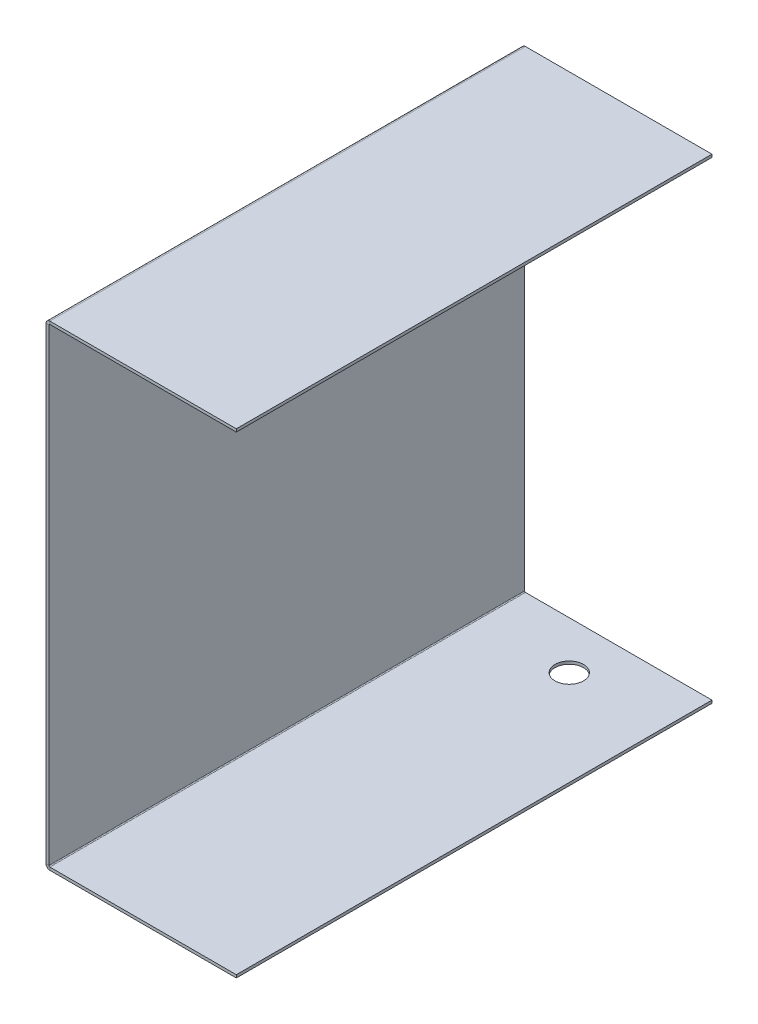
ISO-10303-21;
HEADER;
FILE_DESCRIPTION(('STEP AP214'),'2;1');
FILE_NAME('part.step','',(''),(''),'','','');
FILE_SCHEMA(('AUTOMOTIVE_DESIGN { 1 0 10303 214 1 1 1 1 }'));
ENDSEC;
DATA;
#1=APPLICATION_CONTEXT('core data for automotive mechanical design processes');
#2=APPLICATION_PROTOCOL_DEFINITION('international standard','automotive_design',2000,#1);
#3=PRODUCT_CONTEXT('',#1,'mechanical');
#4=PRODUCT('Part','Part','',(#3));
#5=PRODUCT_RELATED_PRODUCT_CATEGORY('part','',(#4));
#6=PRODUCT_DEFINITION_FORMATION('','',#4);
#7=PRODUCT_DEFINITION_CONTEXT('part definition',#1,'design');
#8=PRODUCT_DEFINITION('design','',#6,#7);
#9=PRODUCT_DEFINITION_SHAPE('','',#8);
#10=(LENGTH_UNIT() NAMED_UNIT(*) SI_UNIT(.MILLI.,.METRE.));
#11=(NAMED_UNIT(*) PLANE_ANGLE_UNIT() SI_UNIT($,.RADIAN.));
#12=(NAMED_UNIT(*) SI_UNIT($,.STERADIAN.) SOLID_ANGLE_UNIT());
#13=UNCERTAINTY_MEASURE_WITH_UNIT(LENGTH_MEASURE(1.E-05),#10,'distance_accuracy_value','');
#14=(GEOMETRIC_REPRESENTATION_CONTEXT(3) GLOBAL_UNCERTAINTY_ASSIGNED_CONTEXT((#13)) GLOBAL_UNIT_ASSIGNED_CONTEXT((#10,
#11,#12)) REPRESENTATION_CONTEXT('',''));
#15=CARTESIAN_POINT('',(0.,0.,0.));
#16=DIRECTION('',(0.,0.,1.));
#17=DIRECTION('',(1.,0.,0.));
#18=AXIS2_PLACEMENT_3D('',#15,#16,#17);
#19=CARTESIAN_POINT('',(-196.,0.,500.000000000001));
#20=DIRECTION('',(0.,0.,1.));
#21=DIRECTION('',(1.,0.,0.));
#22=AXIS2_PLACEMENT_3D('',#19,#20,#21);
#23=PLANE('',#22);
#24=DIRECTION('',(0.,-1.,0.));
#25=VECTOR('',#24,1.);
#26=CARTESIAN_POINT('',(-196.,0.,500.000000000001));
#27=LINE('',#26,#25);
#28=CARTESIAN_POINT('',(-196.,0.,500.000000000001));
#29=VERTEX_POINT('',#28);
#30=CARTESIAN_POINT('',(-196.,-3.00000000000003,500.000000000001));
#31=VERTEX_POINT('',#30);
#32=EDGE_CURVE('E11',#29,#31,#27,.T.);
#33=ORIENTED_EDGE('',*,*,#32,.F.);
#34=CARTESIAN_POINT('',(-196.,-4.00000000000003,500.000000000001));
#35=DIRECTION('',(0.,0.,-1.));
#36=DIRECTION('',(-1.,0.,0.));
#37=AXIS2_PLACEMENT_3D('',#34,#35,#36);
#38=CIRCLE('',#37,4.);
#39=CARTESIAN_POINT('',(-200.,-4.00000000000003,499.999999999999));
#40=VERTEX_POINT('',#39);
#41=EDGE_CURVE('E199',#29,#40,#38,.F.);
#42=ORIENTED_EDGE('',*,*,#41,.T.);
#43=DIRECTION('',(-1.,0.,0.));
#44=VECTOR('',#43,1.);
#45=CARTESIAN_POINT('',(-197.,-4.00000000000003,500.));
#46=LINE('',#45,#44);
#47=CARTESIAN_POINT('',(-197.,-4.00000000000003,500.));
#48=VERTEX_POINT('',#47);
#49=EDGE_CURVE('E39',#48,#40,#46,.T.);
#50=ORIENTED_EDGE('',*,*,#49,.F.);
#51=CARTESIAN_POINT('',(-196.,-4.00000000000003,500.000000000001));
#52=DIRECTION('',(0.,0.,1.));
#53=DIRECTION('',(1.,0.,0.));
#54=AXIS2_PLACEMENT_3D('',#51,#52,#53);
#55=CIRCLE('',#54,1.);
#56=EDGE_CURVE('E187',#31,#48,#55,.T.);
#57=ORIENTED_EDGE('',*,*,#56,.F.);
#58=EDGE_LOOP('',(#33,#42,#50,#57));
#59=FACE_BOUND('',#58,.T.);
#60=ADVANCED_FACE('F31',(#59),#23,.T.);
#61=CARTESIAN_POINT('',(-197.,-4.00000000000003,500.));
#62=DIRECTION('',(0.,0.,1.));
#63=DIRECTION('',(1.,0.,0.));
#64=AXIS2_PLACEMENT_3D('',#61,#62,#63);
#65=PLANE('',#64);
#66=DIRECTION('',(-1.,0.,0.));
#67=VECTOR('',#66,1.);
#68=CARTESIAN_POINT('',(-1.11022302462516E-13,0.,500.));
#69=LINE('',#68,#67);
#70=CARTESIAN_POINT('',(-1.11022302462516E-13,0.,500.));
#71=VERTEX_POINT('',#70);
#72=EDGE_CURVE('E196',#71,#29,#69,.T.);
#73=ORIENTED_EDGE('',*,*,#72,.T.);
#74=ORIENTED_EDGE('',*,*,#32,.T.);
#75=DIRECTION('',(-1.,0.,0.));
#76=VECTOR('',#75,1.);
#77=CARTESIAN_POINT('',(-1.11022302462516E-13,-3.,500.));
#78=LINE('',#77,#76);
#79=CARTESIAN_POINT('',(-1.11022302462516E-13,-3.,500.));
#80=VERTEX_POINT('',#79);
#81=EDGE_CURVE('E190',#80,#31,#78,.T.);
#82=ORIENTED_EDGE('',*,*,#81,.F.);
#83=DIRECTION('',(0.,-1.,0.));
#84=VECTOR('',#83,1.);
#85=CARTESIAN_POINT('',(-1.11022302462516E-13,0.,500.));
#86=LINE('',#85,#84);
#87=EDGE_CURVE('E193',#71,#80,#86,.T.);
#88=ORIENTED_EDGE('',*,*,#87,.F.);
#89=EDGE_LOOP('',(#73,#74,#82,#88));
#90=FACE_BOUND('',#89,.T.);
#91=ADVANCED_FACE('F284',(#90),#65,.T.);
#92=CARTESIAN_POINT('',(-200.,-4.00000000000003,0.));
#93=DIRECTION('',(0.,0.,-1.));
#94=DIRECTION('',(-1.,0.,0.));
#95=AXIS2_PLACEMENT_3D('',#92,#93,#94);
#96=PLANE('',#95);
#97=DIRECTION('',(1.,0.,0.));
#98=VECTOR('',#97,1.);
#99=CARTESIAN_POINT('',(-200.,-4.00000000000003,0.));
#100=LINE('',#99,#98);
#101=CARTESIAN_POINT('',(-200.,-4.00000000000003,0.));
#102=VERTEX_POINT('',#101);
#103=CARTESIAN_POINT('',(-197.,-4.00000000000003,0.));
#104=VERTEX_POINT('',#103);
#105=EDGE_CURVE('E240',#102,#104,#100,.T.);
#106=ORIENTED_EDGE('',*,*,#105,.F.);
#107=CARTESIAN_POINT('',(-196.,-4.00000000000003,0.));
#108=DIRECTION('',(0.,0.,-1.));
#109=DIRECTION('',(-1.,0.,0.));
#110=AXIS2_PLACEMENT_3D('',#107,#108,#109);
#111=CIRCLE('',#110,4.);
#112=CARTESIAN_POINT('',(-196.,0.,0.));
#113=VERTEX_POINT('',#112);
#114=EDGE_CURVE('E166',#113,#102,#111,.F.);
#115=ORIENTED_EDGE('',*,*,#114,.F.);
#116=DIRECTION('',(0.,1.,0.));
#117=VECTOR('',#116,1.);
#118=CARTESIAN_POINT('',(-196.,-3.00000000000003,0.));
#119=LINE('',#118,#117);
#120=CARTESIAN_POINT('',(-196.,-3.00000000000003,0.));
#121=VERTEX_POINT('',#120);
#122=EDGE_CURVE('E238',#121,#113,#119,.T.);
#123=ORIENTED_EDGE('',*,*,#122,.F.);
#124=CARTESIAN_POINT('',(-196.,-4.00000000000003,0.));
#125=DIRECTION('',(0.,0.,1.));
#126=DIRECTION('',(1.,0.,0.));
#127=AXIS2_PLACEMENT_3D('',#124,#125,#126);
#128=CIRCLE('',#127,1.);
#129=EDGE_CURVE('E154',#121,#104,#128,.T.);
#130=ORIENTED_EDGE('',*,*,#129,.T.);
#131=EDGE_LOOP('',(#106,#115,#123,#130));
#132=FACE_BOUND('',#131,.T.);
#133=ADVANCED_FACE('F294',(#132),#96,.T.);
#134=CARTESIAN_POINT('',(-196.,-3.00000000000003,0.));
#135=DIRECTION('',(0.,0.,-1.));
#136=DIRECTION('',(-1.,0.,0.));
#137=AXIS2_PLACEMENT_3D('',#134,#135,#136);
#138=PLANE('',#137);
#139=DIRECTION('',(0.,-1.,0.));
#140=VECTOR('',#139,1.);
#141=CARTESIAN_POINT('',(-200.,0.,0.));
#142=LINE('',#141,#140);
#143=CARTESIAN_POINT('',(-200.,-496.,0.));
#144=VERTEX_POINT('',#143);
#145=EDGE_CURVE('E169',#102,#144,#142,.T.);
#146=ORIENTED_EDGE('',*,*,#145,.F.);
#147=ORIENTED_EDGE('',*,*,#105,.T.);
#148=DIRECTION('',(0.,-1.,0.));
#149=VECTOR('',#148,1.);
#150=CARTESIAN_POINT('',(-197.,0.,0.));
#151=LINE('',#150,#149);
#152=CARTESIAN_POINT('',(-197.,-496.,0.));
#153=VERTEX_POINT('',#152);
#154=EDGE_CURVE('E151',#104,#153,#151,.T.);
#155=ORIENTED_EDGE('',*,*,#154,.T.);
#156=DIRECTION('',(-1.,0.,0.));
#157=VECTOR('',#156,1.);
#158=CARTESIAN_POINT('',(-197.,-496.,0.));
#159=LINE('',#158,#157);
#160=EDGE_CURVE('E130',#153,#144,#159,.T.);
#161=ORIENTED_EDGE('',*,*,#160,.T.);
#162=EDGE_LOOP('',(#146,#147,#155,#161));
#163=FACE_BOUND('',#162,.T.);
#164=ADVANCED_FACE('F296',(#163),#138,.T.);
#165=CARTESIAN_POINT('',(-200.,-496.,499.999999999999));
#166=DIRECTION('',(0.,0.,1.));
#167=DIRECTION('',(1.,0.,0.));
#168=AXIS2_PLACEMENT_3D('',#165,#166,#167);
#169=PLANE('',#168);
#170=DIRECTION('',(1.,0.,0.));
#171=VECTOR('',#170,1.);
#172=CARTESIAN_POINT('',(-200.,-496.,499.999999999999));
#173=LINE('',#172,#171);
#174=CARTESIAN_POINT('',(-200.,-496.,499.999999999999));
#175=VERTEX_POINT('',#174);
#176=CARTESIAN_POINT('',(-197.,-496.,500.));
#177=VERTEX_POINT('',#176);
#178=EDGE_CURVE('E53',#175,#177,#173,.T.);
#179=ORIENTED_EDGE('',*,*,#178,.F.);
#180=CARTESIAN_POINT('',(-196.,-496.,500.000000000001));
#181=DIRECTION('',(0.,0.,-1.));
#182=DIRECTION('',(-1.,0.,0.));
#183=AXIS2_PLACEMENT_3D('',#180,#181,#182);
#184=CIRCLE('',#183,4.);
#185=CARTESIAN_POINT('',(-196.,-500.,500.000000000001));
#186=VERTEX_POINT('',#185);
#187=EDGE_CURVE('E204',#175,#186,#184,.F.);
#188=ORIENTED_EDGE('',*,*,#187,.T.);
#189=DIRECTION('',(0.,-1.,0.));
#190=VECTOR('',#189,1.);
#191=CARTESIAN_POINT('',(-196.,-497.,500.000000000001));
#192=LINE('',#191,#190);
#193=CARTESIAN_POINT('',(-196.,-497.,500.000000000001));
#194=VERTEX_POINT('',#193);
#195=EDGE_CURVE('E46',#194,#186,#192,.T.);
#196=ORIENTED_EDGE('',*,*,#195,.F.);
#197=CARTESIAN_POINT('',(-196.,-496.,500.000000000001));
#198=DIRECTION('',(0.,0.,1.));
#199=DIRECTION('',(1.,0.,0.));
#200=AXIS2_PLACEMENT_3D('',#197,#198,#199);
#201=CIRCLE('',#200,1.);
#202=EDGE_CURVE('E181',#177,#194,#201,.T.);
#203=ORIENTED_EDGE('',*,*,#202,.F.);
#204=EDGE_LOOP('',(#179,#188,#196,#203));
#205=FACE_BOUND('',#204,.T.);
#206=ADVANCED_FACE('F262',(#205),#169,.T.);
#207=CARTESIAN_POINT('',(-196.,-497.,500.000000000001));
#208=DIRECTION('',(0.,0.,1.));
#209=DIRECTION('',(1.,0.,0.));
#210=AXIS2_PLACEMENT_3D('',#207,#208,#209);
#211=PLANE('',#210);
#212=DIRECTION('',(0.,-1.,0.));
#213=VECTOR('',#212,1.);
#214=CARTESIAN_POINT('',(-200.,0.,499.999999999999));
#215=LINE('',#214,#213);
#216=EDGE_CURVE('E202',#40,#175,#215,.T.);
#217=ORIENTED_EDGE('',*,*,#216,.T.);
#218=ORIENTED_EDGE('',*,*,#178,.T.);
#219=DIRECTION('',(0.,-1.,0.));
#220=VECTOR('',#219,1.);
#221=CARTESIAN_POINT('',(-197.,0.,500.));
#222=LINE('',#221,#220);
#223=EDGE_CURVE('E184',#48,#177,#222,.T.);
#224=ORIENTED_EDGE('',*,*,#223,.F.);
#225=ORIENTED_EDGE('',*,*,#49,.T.);
#226=EDGE_LOOP('',(#217,#218,#224,#225));
#227=FACE_BOUND('',#226,.T.);
#228=ADVANCED_FACE('F244',(#227),#211,.T.);
#229=CARTESIAN_POINT('',(-196.,-500.,0.));
#230=DIRECTION('',(0.,0.,-1.));
#231=DIRECTION('',(-1.,0.,0.));
#232=AXIS2_PLACEMENT_3D('',#229,#230,#231);
#233=PLANE('',#232);
#234=DIRECTION('',(0.,1.,0.));
#235=VECTOR('',#234,1.);
#236=CARTESIAN_POINT('',(-196.,-500.,0.));
#237=LINE('',#236,#235);
#238=CARTESIAN_POINT('',(-196.,-500.,0.));
#239=VERTEX_POINT('',#238);
#240=CARTESIAN_POINT('',(-196.,-497.,0.));
#241=VERTEX_POINT('',#240);
#242=EDGE_CURVE('E234',#239,#241,#237,.T.);
#243=ORIENTED_EDGE('',*,*,#242,.F.);
#244=CARTESIAN_POINT('',(-196.,-496.,0.));
#245=DIRECTION('',(0.,0.,-1.));
#246=DIRECTION('',(-1.,0.,0.));
#247=AXIS2_PLACEMENT_3D('',#244,#245,#246);
#248=CIRCLE('',#247,4.);
#249=EDGE_CURVE('E172',#144,#239,#248,.F.);
#250=ORIENTED_EDGE('',*,*,#249,.F.);
#251=ORIENTED_EDGE('',*,*,#160,.F.);
#252=CARTESIAN_POINT('',(-196.,-496.,0.));
#253=DIRECTION('',(0.,0.,1.));
#254=DIRECTION('',(1.,0.,0.));
#255=AXIS2_PLACEMENT_3D('',#252,#253,#254);
#256=CIRCLE('',#255,1.);
#257=EDGE_CURVE('E145',#153,#241,#256,.T.);
#258=ORIENTED_EDGE('',*,*,#257,.T.);
#259=EDGE_LOOP('',(#243,#250,#251,#258));
#260=FACE_BOUND('',#259,.T.);
#261=ADVANCED_FACE('F298',(#260),#233,.T.);
#262=CARTESIAN_POINT('',(-197.,-496.,0.));
#263=DIRECTION('',(0.,0.,-1.));
#264=DIRECTION('',(-1.,0.,0.));
#265=AXIS2_PLACEMENT_3D('',#262,#263,#264);
#266=PLANE('',#265);
#267=DIRECTION('',(1.,0.,0.));
#268=VECTOR('',#267,1.);
#269=CARTESIAN_POINT('',(-200.,-500.,0.));
#270=LINE('',#269,#268);
#271=CARTESIAN_POINT('',(0.,-500.,0.));
#272=VERTEX_POINT('',#271);
#273=EDGE_CURVE('E135',#239,#272,#270,.T.);
#274=ORIENTED_EDGE('',*,*,#273,.F.);
#275=ORIENTED_EDGE('',*,*,#242,.T.);
#276=DIRECTION('',(1.,0.,0.));
#277=VECTOR('',#276,1.);
#278=CARTESIAN_POINT('',(-200.,-497.,0.));
#279=LINE('',#278,#277);
#280=CARTESIAN_POINT('',(0.,-497.,0.));
#281=VERTEX_POINT('',#280);
#282=EDGE_CURVE('E143',#241,#281,#279,.T.);
#283=ORIENTED_EDGE('',*,*,#282,.T.);
#284=DIRECTION('',(0.,-1.,0.));
#285=VECTOR('',#284,1.);
#286=CARTESIAN_POINT('',(0.,-497.,0.));
#287=LINE('',#286,#285);
#288=EDGE_CURVE('E124',#281,#272,#287,.T.);
#289=ORIENTED_EDGE('',*,*,#288,.T.);
#290=EDGE_LOOP('',(#274,#275,#283,#289));
#291=FACE_BOUND('',#290,.T.);
#292=ADVANCED_FACE('F141',(#291),#266,.T.);
#293=CARTESIAN_POINT('',(-200.,-500.,499.999999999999));
#294=DIRECTION('',(0.,1.,0.));
#295=DIRECTION('',(0.,0.,1.));
#296=AXIS2_PLACEMENT_3D('',#293,#294,#295);
#297=PLANE('',#296);
#298=CARTESIAN_POINT('',(-100.,-500.,50.));
#299=DIRECTION('',(0.,-1.,0.));
#300=DIRECTION('',(0.,0.,-1.));
#301=AXIS2_PLACEMENT_3D('',#298,#299,#300);
#302=CIRCLE('',#301,15.);
#303=CARTESIAN_POINT('',(-100.,-500.,35.));
#304=VERTEX_POINT('',#303);
#305=EDGE_CURVE('E538',#304,#304,#302,.T.);
#306=ORIENTED_EDGE('',*,*,#305,.F.);
#307=EDGE_LOOP('',(#306));
#308=FACE_BOUND('',#307,.T.);
#309=ORIENTED_EDGE('',*,*,#273,.T.);
#310=DIRECTION('',(0.,0.,-1.));
#311=VECTOR('',#310,1.);
#312=CARTESIAN_POINT('',(0.,-500.,500.));
#313=LINE('',#312,#311);
#314=CARTESIAN_POINT('',(0.,-500.,500.));
#315=VERTEX_POINT('',#314);
#316=EDGE_CURVE('E120',#315,#272,#313,.T.);
#317=ORIENTED_EDGE('',*,*,#316,.F.);
#318=DIRECTION('',(1.,0.,0.));
#319=VECTOR('',#318,1.);
#320=CARTESIAN_POINT('',(-200.,-500.,499.999999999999));
#321=LINE('',#320,#319);
#322=EDGE_CURVE('E175',#186,#315,#321,.T.);
#323=ORIENTED_EDGE('',*,*,#322,.F.);
#324=DIRECTION('',(0.,0.,-1.));
#325=VECTOR('',#324,1.);
#326=CARTESIAN_POINT('',(-196.,-500.,500.000000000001));
#327=LINE('',#326,#325);
#328=EDGE_CURVE('E138',#186,#239,#327,.T.);
#329=ORIENTED_EDGE('',*,*,#328,.T.);
#330=EDGE_LOOP('',(#309,#317,#323,#329));
#331=FACE_BOUND('',#330,.T.);
#332=ADVANCED_FACE('F136',(#308,#331),#297,.F.);
#333=CARTESIAN_POINT('',(0.,-497.,500.));
#334=DIRECTION('',(1.,0.,0.));
#335=DIRECTION('',(0.,1.,0.));
#336=AXIS2_PLACEMENT_3D('',#333,#334,#335);
#337=PLANE('',#336);
#338=ORIENTED_EDGE('',*,*,#288,.F.);
#339=DIRECTION('',(0.,0.,-1.));
#340=VECTOR('',#339,1.);
#341=CARTESIAN_POINT('',(0.,-497.,500.));
#342=LINE('',#341,#340);
#343=CARTESIAN_POINT('',(0.,-497.,500.));
#344=VERTEX_POINT('',#343);
#345=EDGE_CURVE('E131',#344,#281,#342,.T.);
#346=ORIENTED_EDGE('',*,*,#345,.F.);
#347=DIRECTION('',(0.,-1.,0.));
#348=VECTOR('',#347,1.);
#349=CARTESIAN_POINT('',(0.,-497.,500.));
#350=LINE('',#349,#348);
#351=EDGE_CURVE('E127',#344,#315,#350,.T.);
#352=ORIENTED_EDGE('',*,*,#351,.T.);
#353=ORIENTED_EDGE('',*,*,#316,.T.);
#354=EDGE_LOOP('',(#338,#346,#352,#353));
#355=FACE_BOUND('',#354,.T.);
#356=ADVANCED_FACE('F122',(#355),#337,.T.);
#357=CARTESIAN_POINT('',(-200.,-497.,499.999999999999));
#358=DIRECTION('',(0.,1.,0.));
#359=DIRECTION('',(0.,0.,1.));
#360=AXIS2_PLACEMENT_3D('',#357,#358,#359);
#361=PLANE('',#360);
#362=CARTESIAN_POINT('',(-100.,-497.,50.));
#363=DIRECTION('',(0.,1.,0.));
#364=DIRECTION('',(0.,0.,1.));
#365=AXIS2_PLACEMENT_3D('',#362,#363,#364);
#366=CIRCLE('',#365,15.);
#367=CARTESIAN_POINT('',(-100.,-497.,65.));
#368=VERTEX_POINT('',#367);
#369=EDGE_CURVE('E34',#368,#368,#366,.T.);
#370=ORIENTED_EDGE('',*,*,#369,.F.);
#371=EDGE_LOOP('',(#370));
#372=FACE_BOUND('',#371,.T.);
#373=ORIENTED_EDGE('',*,*,#282,.F.);
#374=DIRECTION('',(0.,0.,-1.));
#375=VECTOR('',#374,1.);
#376=CARTESIAN_POINT('',(-196.,-497.,500.000000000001));
#377=LINE('',#376,#375);
#378=EDGE_CURVE('E229',#194,#241,#377,.T.);
#379=ORIENTED_EDGE('',*,*,#378,.F.);
#380=DIRECTION('',(1.,0.,0.));
#381=VECTOR('',#380,1.);
#382=CARTESIAN_POINT('',(-200.,-497.,499.999999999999));
#383=LINE('',#382,#381);
#384=EDGE_CURVE('E178',#194,#344,#383,.T.);
#385=ORIENTED_EDGE('',*,*,#384,.T.);
#386=ORIENTED_EDGE('',*,*,#345,.T.);
#387=EDGE_LOOP('',(#373,#379,#385,#386));
#388=FACE_BOUND('',#387,.T.);
#389=ADVANCED_FACE('F265',(#372,#388),#361,.T.);
#390=CARTESIAN_POINT('',(-196.,-496.,500.000000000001));
#391=DIRECTION('',(0.,0.,-1.));
#392=DIRECTION('',(-1.,0.,0.));
#393=AXIS2_PLACEMENT_3D('',#390,#391,#392);
#394=CYLINDRICAL_SURFACE('',#393,1.);
#395=ORIENTED_EDGE('',*,*,#257,.F.);
#396=DIRECTION('',(0.,0.,-1.));
#397=VECTOR('',#396,1.);
#398=CARTESIAN_POINT('',(-197.,-496.,500.));
#399=LINE('',#398,#397);
#400=EDGE_CURVE('E226',#177,#153,#399,.T.);
#401=ORIENTED_EDGE('',*,*,#400,.F.);
#402=ORIENTED_EDGE('',*,*,#202,.T.);
#403=ORIENTED_EDGE('',*,*,#378,.T.);
#404=EDGE_LOOP('',(#395,#401,#402,#403));
#405=FACE_BOUND('',#404,.T.);
#406=ADVANCED_FACE('F270',(#405),#394,.F.);
#407=CARTESIAN_POINT('',(-197.,0.,500.));
#408=DIRECTION('',(1.,0.,0.));
#409=DIRECTION('',(0.,1.,0.));
#410=AXIS2_PLACEMENT_3D('',#407,#408,#409);
#411=PLANE('',#410);
#412=ORIENTED_EDGE('',*,*,#154,.F.);
#413=DIRECTION('',(0.,0.,-1.));
#414=VECTOR('',#413,1.);
#415=CARTESIAN_POINT('',(-197.,-4.00000000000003,500.));
#416=LINE('',#415,#414);
#417=EDGE_CURVE('E223',#48,#104,#416,.T.);
#418=ORIENTED_EDGE('',*,*,#417,.F.);
#419=ORIENTED_EDGE('',*,*,#223,.T.);
#420=ORIENTED_EDGE('',*,*,#400,.T.);
#421=EDGE_LOOP('',(#412,#418,#419,#420));
#422=FACE_BOUND('',#421,.T.);
#423=ADVANCED_FACE('F273',(#422),#411,.T.);
#424=CARTESIAN_POINT('',(-196.,-4.00000000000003,500.000000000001));
#425=DIRECTION('',(0.,0.,-1.));
#426=DIRECTION('',(-1.,0.,0.));
#427=AXIS2_PLACEMENT_3D('',#424,#425,#426);
#428=CYLINDRICAL_SURFACE('',#427,1.);
#429=ORIENTED_EDGE('',*,*,#129,.F.);
#430=DIRECTION('',(0.,0.,-1.));
#431=VECTOR('',#430,1.);
#432=CARTESIAN_POINT('',(-196.,-3.00000000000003,500.000000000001));
#433=LINE('',#432,#431);
#434=EDGE_CURVE('E220',#31,#121,#433,.T.);
#435=ORIENTED_EDGE('',*,*,#434,.F.);
#436=ORIENTED_EDGE('',*,*,#56,.T.);
#437=ORIENTED_EDGE('',*,*,#417,.T.);
#438=EDGE_LOOP('',(#429,#435,#436,#437));
#439=FACE_BOUND('',#438,.T.);
#440=ADVANCED_FACE('F276',(#439),#428,.F.);
#441=CARTESIAN_POINT('',(-1.11022302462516E-13,-3.,500.));
#442=DIRECTION('',(0.,-1.,0.));
#443=DIRECTION('',(1.,0.,0.));
#444=AXIS2_PLACEMENT_3D('',#441,#442,#443);
#445=PLANE('',#444);
#446=DIRECTION('',(-1.,0.,0.));
#447=VECTOR('',#446,1.);
#448=CARTESIAN_POINT('',(0.,-3.,0.));
#449=LINE('',#448,#447);
#450=CARTESIAN_POINT('',(0.,-3.,0.));
#451=VERTEX_POINT('',#450);
#452=EDGE_CURVE('E157',#451,#121,#449,.T.);
#453=ORIENTED_EDGE('',*,*,#452,.F.);
#454=DIRECTION('',(0.,0.,-1.));
#455=VECTOR('',#454,1.);
#456=CARTESIAN_POINT('',(-1.11022302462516E-13,-3.,500.));
#457=LINE('',#456,#455);
#458=EDGE_CURVE('E218',#80,#451,#457,.T.);
#459=ORIENTED_EDGE('',*,*,#458,.F.);
#460=ORIENTED_EDGE('',*,*,#81,.T.);
#461=ORIENTED_EDGE('',*,*,#434,.T.);
#462=EDGE_LOOP('',(#453,#459,#460,#461));
#463=FACE_BOUND('',#462,.T.);
#464=ADVANCED_FACE('F281',(#463),#445,.T.);
#465=CARTESIAN_POINT('',(-1.11022302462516E-13,0.,500.));
#466=DIRECTION('',(1.,0.,0.));
#467=DIRECTION('',(0.,1.,0.));
#468=AXIS2_PLACEMENT_3D('',#465,#466,#467);
#469=PLANE('',#468);
#470=DIRECTION('',(0.,-1.,0.));
#471=VECTOR('',#470,1.);
#472=CARTESIAN_POINT('',(0.,0.,0.));
#473=LINE('',#472,#471);
#474=CARTESIAN_POINT('',(0.,0.,0.));
#475=VERTEX_POINT('',#474);
#476=EDGE_CURVE('E160',#475,#451,#473,.T.);
#477=ORIENTED_EDGE('',*,*,#476,.F.);
#478=DIRECTION('',(0.,0.,-1.));
#479=VECTOR('',#478,1.);
#480=CARTESIAN_POINT('',(-1.11022302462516E-13,0.,500.));
#481=LINE('',#480,#479);
#482=EDGE_CURVE('E216',#71,#475,#481,.T.);
#483=ORIENTED_EDGE('',*,*,#482,.F.);
#484=ORIENTED_EDGE('',*,*,#87,.T.);
#485=ORIENTED_EDGE('',*,*,#458,.T.);
#486=EDGE_LOOP('',(#477,#483,#484,#485));
#487=FACE_BOUND('',#486,.T.);
#488=ADVANCED_FACE('F287',(#487),#469,.T.);
#489=CARTESIAN_POINT('',(-1.11022302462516E-13,0.,500.));
#490=DIRECTION('',(0.,-1.,0.));
#491=DIRECTION('',(1.,0.,0.));
#492=AXIS2_PLACEMENT_3D('',#489,#490,#491);
#493=PLANE('',#492);
#494=DIRECTION('',(-1.,0.,0.));
#495=VECTOR('',#494,1.);
#496=CARTESIAN_POINT('',(0.,0.,0.));
#497=LINE('',#496,#495);
#498=EDGE_CURVE('E163',#475,#113,#497,.T.);
#499=ORIENTED_EDGE('',*,*,#498,.T.);
#500=DIRECTION('',(0.,0.,-1.));
#501=VECTOR('',#500,1.);
#502=CARTESIAN_POINT('',(-196.,0.,500.000000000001));
#503=LINE('',#502,#501);
#504=EDGE_CURVE('E213',#29,#113,#503,.T.);
#505=ORIENTED_EDGE('',*,*,#504,.F.);
#506=ORIENTED_EDGE('',*,*,#72,.F.);
#507=ORIENTED_EDGE('',*,*,#482,.T.);
#508=EDGE_LOOP('',(#499,#505,#506,#507));
#509=FACE_BOUND('',#508,.T.);
#510=ADVANCED_FACE('F292',(#509),#493,.F.);
#511=CARTESIAN_POINT('',(-196.,-4.00000000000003,500.000000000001));
#512=DIRECTION('',(0.,0.,-1.));
#513=DIRECTION('',(-1.,0.,0.));
#514=AXIS2_PLACEMENT_3D('',#511,#512,#513);
#515=CYLINDRICAL_SURFACE('',#514,4.);
#516=ORIENTED_EDGE('',*,*,#114,.T.);
#517=DIRECTION('',(0.,0.,-1.));
#518=VECTOR('',#517,1.);
#519=CARTESIAN_POINT('',(-200.,-4.00000000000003,499.999999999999));
#520=LINE('',#519,#518);
#521=EDGE_CURVE('E210',#40,#102,#520,.T.);
#522=ORIENTED_EDGE('',*,*,#521,.F.);
#523=ORIENTED_EDGE('',*,*,#41,.F.);
#524=ORIENTED_EDGE('',*,*,#504,.T.);
#525=EDGE_LOOP('',(#516,#522,#523,#524));
#526=FACE_BOUND('',#525,.T.);
#527=ADVANCED_FACE('F253',(#526),#515,.T.);
#528=CARTESIAN_POINT('',(-200.,0.,499.999999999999));
#529=DIRECTION('',(1.,0.,0.));
#530=DIRECTION('',(0.,1.,0.));
#531=AXIS2_PLACEMENT_3D('',#528,#529,#530);
#532=PLANE('',#531);
#533=ORIENTED_EDGE('',*,*,#145,.T.);
#534=DIRECTION('',(0.,0.,-1.));
#535=VECTOR('',#534,1.);
#536=CARTESIAN_POINT('',(-200.,-496.,499.999999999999));
#537=LINE('',#536,#535);
#538=EDGE_CURVE('E207',#175,#144,#537,.T.);
#539=ORIENTED_EDGE('',*,*,#538,.F.);
#540=ORIENTED_EDGE('',*,*,#216,.F.);
#541=ORIENTED_EDGE('',*,*,#521,.T.);
#542=EDGE_LOOP('',(#533,#539,#540,#541));
#543=FACE_BOUND('',#542,.T.);
#544=ADVANCED_FACE('F257',(#543),#532,.F.);
#545=CARTESIAN_POINT('',(-196.,-496.,500.000000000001));
#546=DIRECTION('',(0.,0.,-1.));
#547=DIRECTION('',(-1.,0.,0.));
#548=AXIS2_PLACEMENT_3D('',#545,#546,#547);
#549=CYLINDRICAL_SURFACE('',#548,4.);
#550=ORIENTED_EDGE('',*,*,#249,.T.);
#551=ORIENTED_EDGE('',*,*,#328,.F.);
#552=ORIENTED_EDGE('',*,*,#187,.F.);
#553=ORIENTED_EDGE('',*,*,#538,.T.);
#554=EDGE_LOOP('',(#550,#551,#552,#553));
#555=FACE_BOUND('',#554,.T.);
#556=ADVANCED_FACE('F261',(#555),#549,.T.);
#557=CARTESIAN_POINT('',(-196.,-496.,500.000000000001));
#558=DIRECTION('',(0.,0.,1.));
#559=DIRECTION('',(1.,0.,0.));
#560=AXIS2_PLACEMENT_3D('',#557,#558,#559);
#561=PLANE('',#560);
#562=ORIENTED_EDGE('',*,*,#322,.T.);
#563=ORIENTED_EDGE('',*,*,#351,.F.);
#564=ORIENTED_EDGE('',*,*,#384,.F.);
#565=ORIENTED_EDGE('',*,*,#195,.T.);
#566=EDGE_LOOP('',(#562,#563,#564,#565));
#567=FACE_BOUND('',#566,.T.);
#568=ADVANCED_FACE('F268',(#567),#561,.T.);
#569=CARTESIAN_POINT('',(-196.,-496.,0.));
#570=DIRECTION('',(0.,0.,1.));
#571=DIRECTION('',(1.,0.,0.));
#572=AXIS2_PLACEMENT_3D('',#569,#570,#571);
#573=PLANE('',#572);
#574=ORIENTED_EDGE('',*,*,#452,.T.);
#575=ORIENTED_EDGE('',*,*,#122,.T.);
#576=ORIENTED_EDGE('',*,*,#498,.F.);
#577=ORIENTED_EDGE('',*,*,#476,.T.);
#578=EDGE_LOOP('',(#574,#575,#576,#577));
#579=FACE_BOUND('',#578,.T.);
#580=ADVANCED_FACE('F459',(#579),#573,.F.);
#581=CARTESIAN_POINT('',(-100.,-496.,50.));
#582=DIRECTION('',(0.,-1.,0.));
#583=DIRECTION('',(0.,0.,-1.));
#584=AXIS2_PLACEMENT_3D('',#581,#582,#583);
#585=CYLINDRICAL_SURFACE('',#584,15.);
#586=ORIENTED_EDGE('',*,*,#369,.T.);
#587=EDGE_LOOP('',(#586));
#588=FACE_BOUND('',#587,.T.);
#589=ORIENTED_EDGE('',*,*,#305,.T.);
#590=EDGE_LOOP('',(#589));
#591=FACE_BOUND('',#590,.T.);
#592=ADVANCED_FACE('F469',(#588,#591),#585,.F.);
#593=CLOSED_SHELL('',(#60,#91,#133,#164,#206,#228,#261,#292,#332,#356,#389,#406,#423,#440,#464,
#488,#510,#527,#544,#556,#568,#580,#592));
#594=MANIFOLD_SOLID_BREP('B2',#593);
#595=ADVANCED_BREP_SHAPE_REPRESENTATION('',(#18,#594),#14);
#596=SHAPE_DEFINITION_REPRESENTATION(#9,#595);
ENDSEC;
END-ISO-10303-21;
